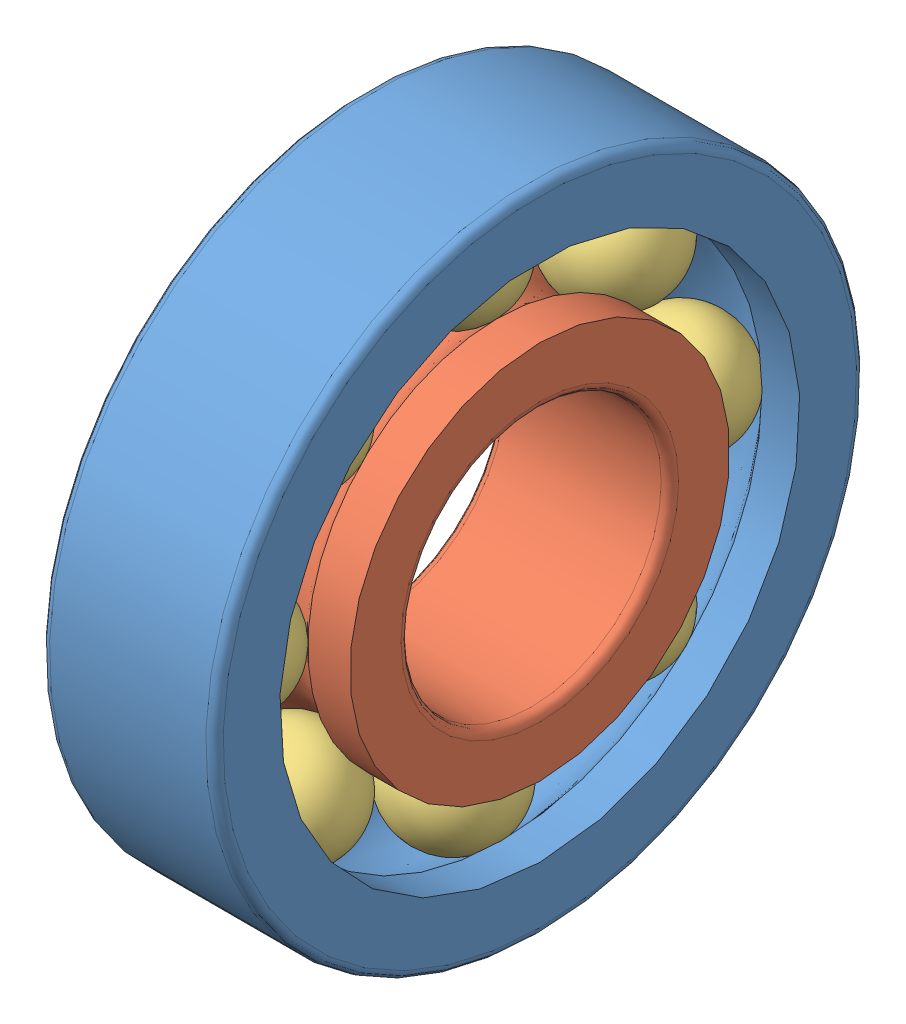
SolidWorks assembly Michaud_Chailly_L1_16101.sldasm, configuration Michaud Chailly L1-16101 (file format 3100). Lengths in mm.
Overall size (8 30 30).
10 component instances, 3 part files, 0 mates.
Components (placement in the parent):
- Michaud_Chailly_L1_16101_PART1-1: Michaud_Chailly_L1_16101_PART1.sldprt [Défaut] at origin size (8 30 30)
- Michaud_Chailly_L1_16101_PART2-1: Michaud_Chailly_L1_16101_PART2.sldprt [Défaut] at origin size (8 17.51 17.51)
- Michaud_Chailly_L1_16101_PART3-1: Michaud_Chailly_L1_16101_PART3.sldprt [Défaut] at origin size (5.4 5.4 5.4)
- Michaud_Chailly_L1_16101_PART3-2: Michaud_Chailly_L1_16101_PART3.sldprt [Défaut] x (1 0 0) z (0 0.707107 0.707107) size (5.4 5.4 5.4)
- Michaud_Chailly_L1_16101_PART3-3: Michaud_Chailly_L1_16101_PART3.sldprt [Défaut] x (1 0 0) z (0 1 0) size (5.4 5.4 5.4)
- Michaud_Chailly_L1_16101_PART3-4: Michaud_Chailly_L1_16101_PART3.sldprt [Défaut] x (1 0 0) z (0 0.707107 -0.707107) size (5.4 5.4 5.4)
- Michaud_Chailly_L1_16101_PART3-5: Michaud_Chailly_L1_16101_PART3.sldprt [Défaut] x (1 0 0) z (0 0 -1) size (5.4 5.4 5.4)
- Michaud_Chailly_L1_16101_PART3-6: Michaud_Chailly_L1_16101_PART3.sldprt [Défaut] x (1 0 0) z (0 -0.707107 -0.707107) size (5.4 5.4 5.4)
- Michaud_Chailly_L1_16101_PART3-7: Michaud_Chailly_L1_16101_PART3.sldprt [Défaut] x (1 0 0) z (0 -1 0) size (5.4 5.4 5.4)
- Michaud_Chailly_L1_16101_PART3-8: Michaud_Chailly_L1_16101_PART3.sldprt [Défaut] x (1 0 0) z (0 -0.707107 0.707107) size (5.4 5.4 5.4)
